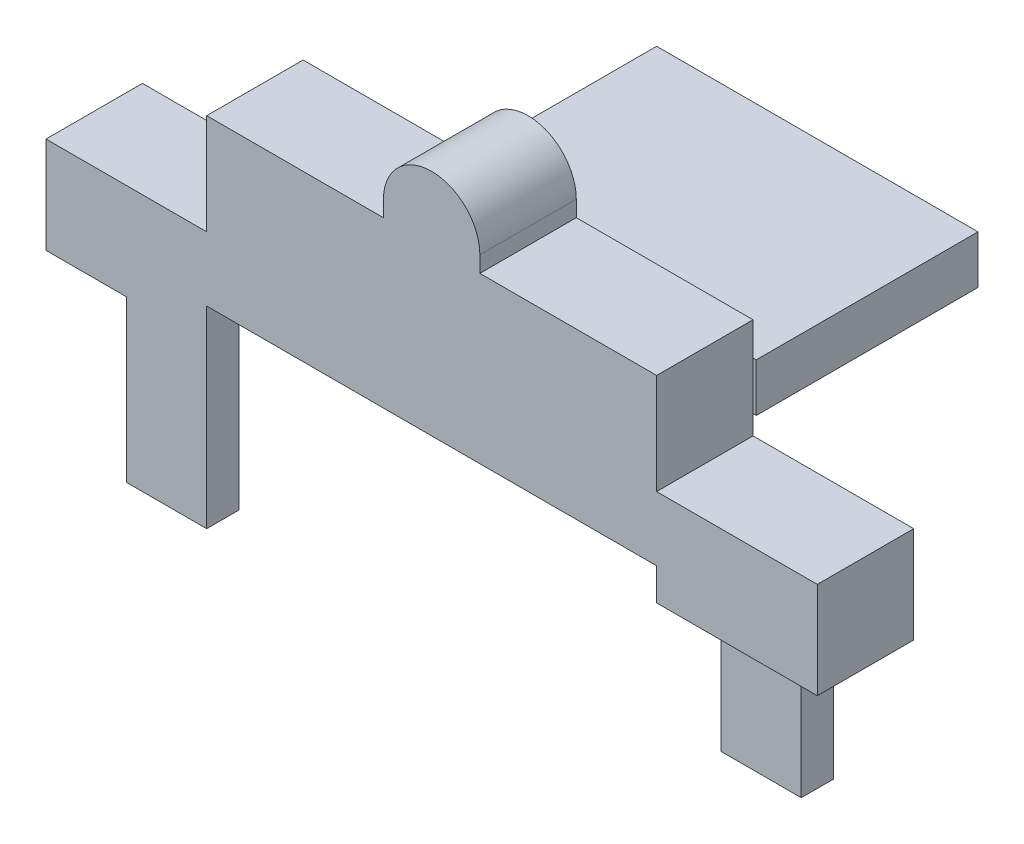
from build123d import *

# Parameters (mm, degrees)
SKETCH2_W                = 14
SKETCH2_H                = 5.13
BOSS_EXTRUDE1_DEPTH      = 3
SKETCH3_W                = 10
SKETCH3_H                = 12
BOSS_EXTRUDE2_DEPTH      = 2
BOSS_EXTRUDE3_DEPTH      = 1
BOSS_EXTRUDE3_DEPTH_BACK = 2
SKETCH4_W                = 5
SKETCH4_H                = 3
SKETCH7_W                = 2.5
SKETCH7_H                = 1
BOSS_EXTRUDE4_DEPTH      = 6
SKETCH9_W                = 2.15
SKETCH9_H                = 2.1
CUT_EXTRUDE1_DEPTH       = 10
SKETCH10_W               = 10
SKETCH10_H               = 9
CUT_EXTRUDE2_DEPTH       = 0.5
SKETCH11_W               = 5.7
SKETCH11_H               = 2.1
BOSS_EXTRUDE5_DEPTH      = 0.5


with BuildPart() as part:
    # Sketch2 → Boss-Extrude1 (new body)
    with BuildSketch(Plane.XY):
        with Locations((-7, 2.565)):
            Rectangle(SKETCH2_W, SKETCH2_H)
        with BuildLine():
            Line((-5.5, 5.63), (-5.5, 4.63))
            ThreePointArc((-5.5, 4.63), (-7, 3.13), (-8.5, 4.63))
            Line((-8.5, 4.63), (-8.5, 5.63))
            ThreePointArc((-8.5, 5.63), (-7, 7.13), (-5.5, 5.63))
        make_face()
    extrude(amount=BOSS_EXTRUDE1_DEPTH)

    # Sketch3 → Boss-Extrude2 (add)
    with BuildSketch(Plane.XZ):
        with Locations((-7, -3)):
            Rectangle(SKETCH3_W, SKETCH3_H)
    extrude(amount=-BOSS_EXTRUDE2_DEPTH)

    # Sketch4 → Boss-Extrude3 (add, two sides: drawn at the far end of the back side and taken through both)
    with BuildSketch(Plane.XZ.offset(-BOSS_EXTRUDE3_DEPTH_BACK)):
        with Locations((-16.5, 1.5)):
            Rectangle(SKETCH4_W, SKETCH4_H)
        with Locations((2.5, 1.5)):
            Rectangle(SKETCH4_W, SKETCH4_H)
    extrude(amount=BOSS_EXTRUDE3_DEPTH + BOSS_EXTRUDE3_DEPTH_BACK)

    # Sketch7 → Boss-Extrude4 (add)
    with BuildSketch(Plane.XZ):
        with Locations((1.25, 0.5)):
            Rectangle(SKETCH7_W, SKETCH7_H)
        with Locations((-15.25, 2.5)):
            Rectangle(SKETCH7_W, SKETCH7_H)
    extrude(amount=BOSS_EXTRUDE4_DEPTH)

    # Sketch9 → Cut-Extrude1 (cut)
    with BuildSketch(Plane.XZ):
        with Locations((-10.925, -1.05)):
            Rectangle(SKETCH9_W, SKETCH9_H)
        with Locations((-3.075, -1.05)):
            Rectangle(SKETCH9_W, SKETCH9_H)
    extrude(amount=-CUT_EXTRUDE1_DEPTH, mode=Mode.SUBTRACT)

    # Sketch10 → Cut-Extrude2 (cut)
    with BuildSketch(Plane(origin=(0, 0, 0), x_dir=(-1, 0, 0), z_dir=(0, -1, 0))):
        with Locations((7, 4.5)):
            Rectangle(SKETCH10_W, SKETCH10_H)
    extrude(amount=-CUT_EXTRUDE2_DEPTH, mode=Mode.SUBTRACT)

    # Sketch11 → Boss-Extrude5 (add)
    with BuildSketch(Plane.XZ.offset(-0.5)):
        with Locations((-7, -1.05)):
            Rectangle(SKETCH11_W, SKETCH11_H)
    extrude(amount=BOSS_EXTRUDE5_DEPTH)


solid = part.part
